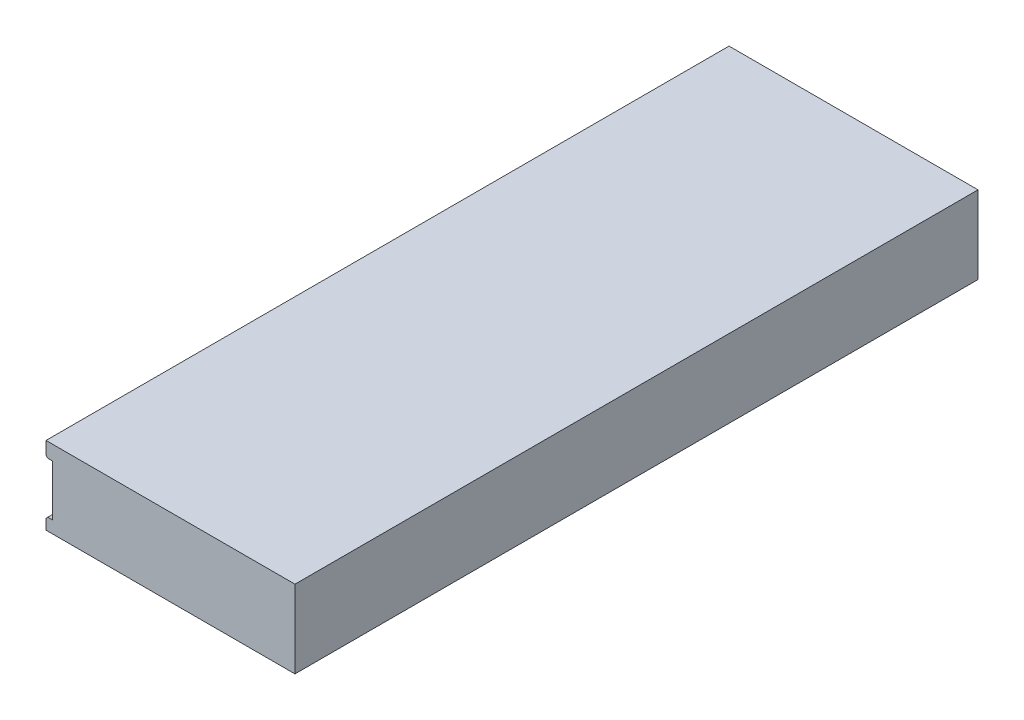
from build123d import *

# Parameters (mm, degrees)
EXTRUDE1_DEPTH                   = 71.4248
F_10_32_TAPPED_HOLE1_D           = 4.0386
F_10_32_TAPPED_HOLE1_DEPTH       = 9.99744
F_10_32_TAPPED_HOLE1_CBORE_D     = 4.826
F_10_32_TAPPED_HOLE1_CBORE_DEPTH = 7.62
F_10_32_TAPPED_HOLE1_TIP         = 1.213317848
CHAMFER1_SIZE                    = 0.381


with BuildPart() as part:
    # Sketch1 → Extrude1 (new, symmetric)
    with BuildSketch(Plane.XY):
        Polygon((50.673, 0), (50.673, -16.256), (-1.397, -16.256), (-1.397, -13.716), (0, -13.716), (0, -3.048), (-1.397, -3.048), (-1.397, 0), align=None)
    extrude(amount=EXTRUDE1_DEPTH, both=True)

    # 10-32 Tapped Hole1
    with Locations(Plane(origin=(0, -8.128, -66.548), x_dir=(0, 0, -1), z_dir=(-1, 0, 0))):
        with Locations((0, 0), (-133.096, 0), (-71.4248, 0), (-61.6712, 0)):
            CounterBoreHole(F_10_32_TAPPED_HOLE1_D / 2, F_10_32_TAPPED_HOLE1_CBORE_D / 2, F_10_32_TAPPED_HOLE1_CBORE_DEPTH, depth=F_10_32_TAPPED_HOLE1_DEPTH)
            with Locations((0, 0, -(F_10_32_TAPPED_HOLE1_DEPTH + F_10_32_TAPPED_HOLE1_TIP / 2))):  # 118° drill point
                Cone(0, F_10_32_TAPPED_HOLE1_D / 2, F_10_32_TAPPED_HOLE1_TIP, mode=Mode.SUBTRACT)

    # Chamfer1
    chamfer1_edges = [part.edges().sort_by_distance(p)[0] for p in [
        (-1.397, -13.716, 0),
        (-1.397, -3.048, 0),
    ]]
    chamfer(chamfer1_edges, length=CHAMFER1_SIZE)


solid = part.part
